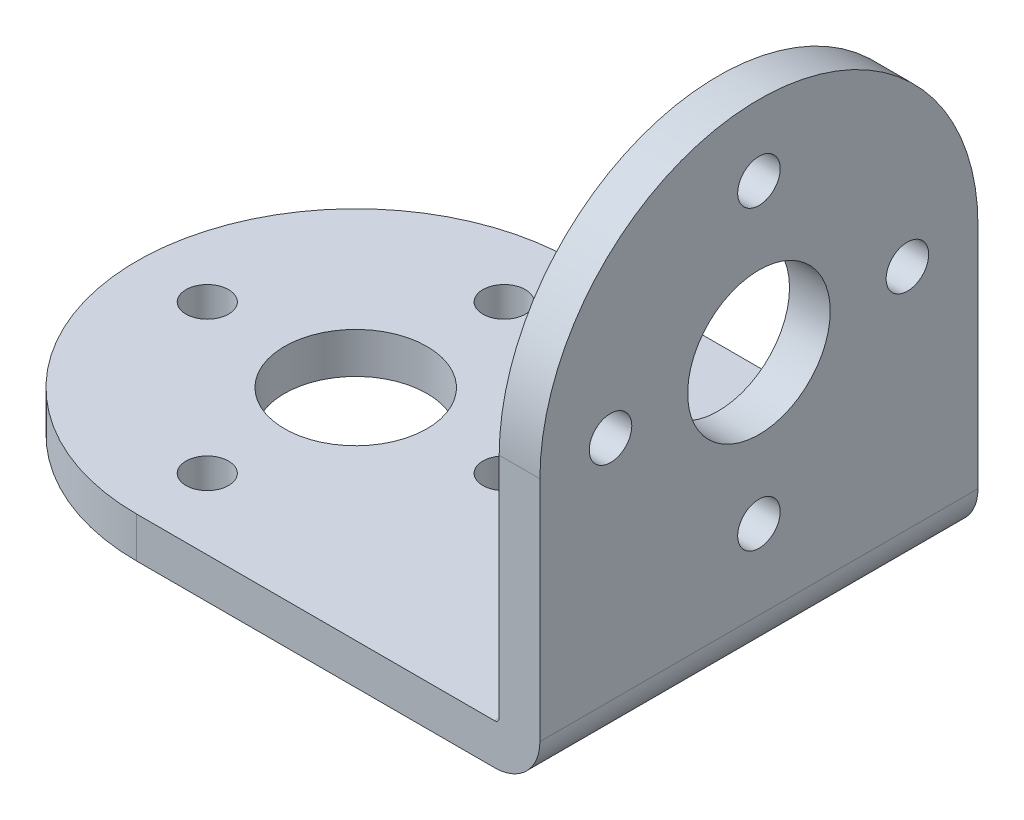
from build123d import *

# Parameters (mm, degrees)
SKETCH1_R      = 4.0005
SKETCH1_R_2    = 1.1938
EXTRUDE1_DEPTH = 2.286
SKETCH2_R      = 4.0005
SKETCH2_R_2    = 1.1938
EXTRUDE2_DEPTH = 2.286
FILLET1_R      = 0.254
FILLET2_R      = 2.54


with BuildPart() as part:
    # Sketch1 → Extrude1 (new body)
    with BuildSketch(Plane(origin=(0, 0, 0), x_dir=(1, 0, 0), z_dir=(0, 1, 0))):
        with BuildLine():
            Line((-22.6314, 12.2936), (0, 12.2936))
            Line((0, 12.2936), (0, -12.2936))
            Line((0, -12.2936), (-22.6314, -12.2936))
            ThreePointArc((-22.6314, -12.2936), (-34.925, 0), (-22.6314, 12.2936))
        make_face()
        with Locations(Location((-22.6314, 0, 0), (0, 0, 90))):
            Circle(SKETCH1_R, mode=Mode.SUBTRACT)
        with Locations(Location((-22.6314, -8.3312, 0), (0, 0, 90))):
            Circle(SKETCH1_R_2, mode=Mode.SUBTRACT)
        with Locations(Location((-30.9626, 0, 0), (0, 0, 90))):
            Circle(SKETCH1_R_2, mode=Mode.SUBTRACT)
        with Locations(Location((-14.3002, 0, 0), (0, 0, 90))):
            Circle(SKETCH1_R_2, mode=Mode.SUBTRACT)
        with Locations(Location((-22.6314, 8.3312, 0), (0, 0, 90))):
            Circle(SKETCH1_R_2, mode=Mode.SUBTRACT)
    extrude(amount=EXTRUDE1_DEPTH)

    # Sketch2 → Extrude2 (add)
    with BuildSketch(Plane(origin=(0, 0, 0), x_dir=(0, 0, -1), z_dir=(1, 0, 0))):
        with BuildLine():
            Line((-12.2936, 15.3162), (-12.2936, 0))
            Line((-12.2936, 0), (12.2936, 0))
            Line((12.2936, 0), (12.2936, 15.3162))
            ThreePointArc((12.2936, 15.3162), (0, 27.6098), (-12.2936, 15.3162))
        make_face()
        with Locations((0, 15.3162)):
            Circle(SKETCH2_R, mode=Mode.SUBTRACT)
        with Locations((-8.3312, 15.3162)):
            Circle(SKETCH2_R_2, mode=Mode.SUBTRACT)
        with Locations((0, 23.6474)):
            Circle(SKETCH2_R_2, mode=Mode.SUBTRACT)
        with Locations((8.3312, 15.3162)):
            Circle(SKETCH2_R_2, mode=Mode.SUBTRACT)
        with Locations((0, 6.985)):
            Circle(SKETCH2_R_2, mode=Mode.SUBTRACT)
    extrude(amount=-EXTRUDE2_DEPTH)

    # Fillet1
    fillet1_edges = [part.edges().sort_by_distance(p)[0] for p in [
        (-2.286, 2.286, 0),
    ]]
    fillet(fillet1_edges, radius=FILLET1_R)

    # Fillet2
    fillet2_edges = [part.edges().sort_by_distance(p)[0] for p in [
        (0, 0, 0),
    ]]
    fillet(fillet2_edges, radius=FILLET2_R)


solid = part.part
